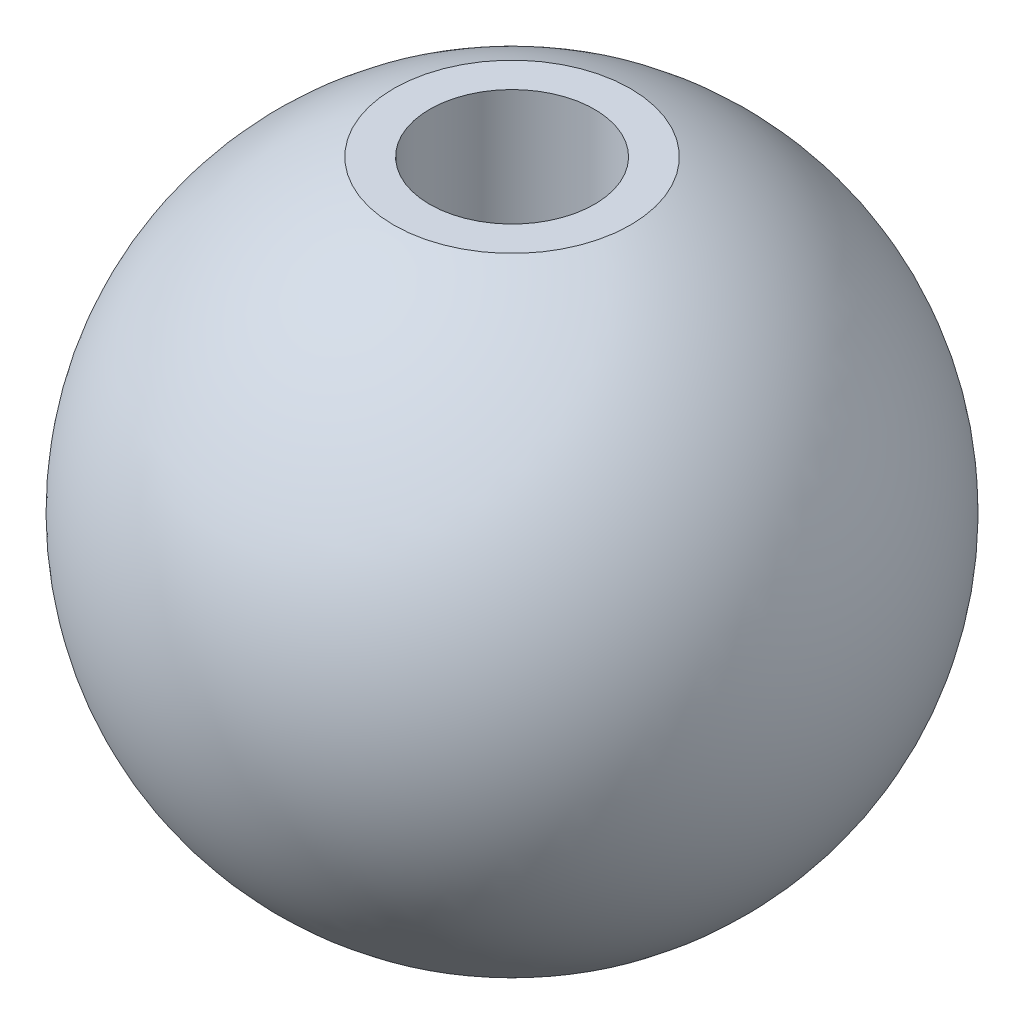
ISO-10303-21;
HEADER;
FILE_DESCRIPTION(('STEP AP214'),'2;1');
FILE_NAME('part.step','',(''),(''),'','','');
FILE_SCHEMA(('AUTOMOTIVE_DESIGN { 1 0 10303 214 1 1 1 1 }'));
ENDSEC;
DATA;
#1=APPLICATION_CONTEXT('core data for automotive mechanical design processes');
#2=APPLICATION_PROTOCOL_DEFINITION('international standard','automotive_design',2000,#1);
#3=PRODUCT_CONTEXT('',#1,'mechanical');
#4=PRODUCT('Part','Part','',(#3));
#5=PRODUCT_RELATED_PRODUCT_CATEGORY('part','',(#4));
#6=PRODUCT_DEFINITION_FORMATION('','',#4);
#7=PRODUCT_DEFINITION_CONTEXT('part definition',#1,'design');
#8=PRODUCT_DEFINITION('design','',#6,#7);
#9=PRODUCT_DEFINITION_SHAPE('','',#8);
#10=(LENGTH_UNIT() NAMED_UNIT(*) SI_UNIT(.MILLI.,.METRE.));
#11=(NAMED_UNIT(*) PLANE_ANGLE_UNIT() SI_UNIT($,.RADIAN.));
#12=(NAMED_UNIT(*) SI_UNIT($,.STERADIAN.) SOLID_ANGLE_UNIT());
#13=UNCERTAINTY_MEASURE_WITH_UNIT(LENGTH_MEASURE(1.E-05),#10,'distance_accuracy_value','');
#14=(GEOMETRIC_REPRESENTATION_CONTEXT(3) GLOBAL_UNCERTAINTY_ASSIGNED_CONTEXT((#13)) GLOBAL_UNIT_ASSIGNED_CONTEXT((#10,
#11,#12)) REPRESENTATION_CONTEXT('',''));
#15=CARTESIAN_POINT('',(0.,0.,0.));
#16=DIRECTION('',(0.,0.,1.));
#17=DIRECTION('',(1.,0.,0.));
#18=AXIS2_PLACEMENT_3D('',#15,#16,#17);
#19=CARTESIAN_POINT('',(0.,0.,0.));
#20=DIRECTION('',(0.,1.,0.));
#21=DIRECTION('',(1.,0.,0.));
#22=AXIS2_PLACEMENT_3D('',#19,#20,#21);
#23=SPHERICAL_SURFACE('',#22,19.05);
#24=CARTESIAN_POINT('',(0.,-17.78,0.));
#25=DIRECTION('',(0.,1.,0.));
#26=DIRECTION('',(0.,0.,1.));
#27=AXIS2_PLACEMENT_3D('',#24,#25,#26);
#28=CIRCLE('',#27,6.83915930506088);
#29=CARTESIAN_POINT('',(6.83915930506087,-17.78,0.));
#30=VERTEX_POINT('',#29);
#31=EDGE_CURVE('E43',#30,#30,#28,.F.);
#32=CARTESIAN_POINT('',(0.,17.78,0.));
#33=DIRECTION('',(0.,1.,0.));
#34=DIRECTION('',(0.,0.,1.));
#35=AXIS2_PLACEMENT_3D('',#32,#33,#34);
#36=CIRCLE('',#35,6.83915930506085);
#37=CARTESIAN_POINT('',(6.83915930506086,17.78,0.));
#38=VERTEX_POINT('',#37);
#39=EDGE_CURVE('E11',#38,#38,#36,.F.);
#40=CARTESIAN_POINT('',(6.83915930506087,-17.78,0.));
#41=CARTESIAN_POINT('',(7.06207478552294,-17.6942569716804,0.));
#42=CARTESIAN_POINT('',(7.28337599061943,-17.6043176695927,0.));
#43=CARTESIAN_POINT('',(7.72244076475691,-17.4161829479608,0.));
#44=CARTESIAN_POINT('',(7.94020433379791,-17.3179875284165,0.));
#45=CARTESIAN_POINT('',(8.37188475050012,-17.1134770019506,0.));
#46=CARTESIAN_POINT('',(8.58580159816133,-17.007161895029,0.));
#47=CARTESIAN_POINT('',(9.0094862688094,-16.7865630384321,0.));
#48=CARTESIAN_POINT('',(9.21925409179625,-16.6722792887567,0.));
#49=CARTESIAN_POINT('',(9.63434391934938,-16.4359046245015,0.));
#50=CARTESIAN_POINT('',(9.83966592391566,-16.3138137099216,0.));
#51=CARTESIAN_POINT('',(10.2455737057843,-16.0619974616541,0.));
#52=CARTESIAN_POINT('',(10.4461594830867,-15.9322721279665,0.));
#53=CARTESIAN_POINT('',(10.842311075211,-15.6653705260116,0.));
#54=CARTESIAN_POINT('',(11.037876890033,-15.5281942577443,0.));
#55=CARTESIAN_POINT('',(11.4237119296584,-15.2465848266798,0.));
#56=CARTESIAN_POINT('',(11.6139811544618,-15.1021516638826,0.));
#57=CARTESIAN_POINT('',(11.9889538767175,-14.8062327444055,0.));
#58=CARTESIAN_POINT('',(12.1736573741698,-14.6547469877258,0.));
#59=CARTESIAN_POINT('',(12.5372373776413,-14.3449371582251,0.));
#60=CARTESIAN_POINT('',(12.7161138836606,-14.1866130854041,0.));
#61=CARTESIAN_POINT('',(13.0677868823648,-13.8633505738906,0.));
#62=CARTESIAN_POINT('',(13.2405833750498,-13.698412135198,0.));
#63=CARTESIAN_POINT('',(13.5798519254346,-13.3621541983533,0.));
#64=CARTESIAN_POINT('',(13.7463239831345,-13.1908347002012,0.));
#65=CARTESIAN_POINT('',(14.0727081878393,-12.8420569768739,0.));
#66=CARTESIAN_POINT('',(14.2326203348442,-12.6645987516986,0.));
#67=CARTESIAN_POINT('',(14.5456585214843,-12.3037945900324,0.));
#68=CARTESIAN_POINT('',(14.6987845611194,-12.1204486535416,0.));
#69=CARTESIAN_POINT('',(14.9980339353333,-11.748128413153,0.));
#70=CARTESIAN_POINT('',(15.144157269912,-11.5591541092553,0.));
#71=CARTESIAN_POINT('',(15.4291945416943,-11.1758444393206,0.));
#72=CARTESIAN_POINT('',(15.5681084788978,-10.9815090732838,0.));
#73=CARTESIAN_POINT('',(15.8385304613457,-10.5877521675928,0.));
#74=CARTESIAN_POINT('',(15.9700385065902,-10.3883306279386,0.));
#75=CARTESIAN_POINT('',(16.2254626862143,-9.98468345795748,0.));
#76=CARTESIAN_POINT('',(16.3493788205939,-9.78045782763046,0.));
#77=CARTESIAN_POINT('',(16.5894438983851,-9.36749135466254,0.));
#78=CARTESIAN_POINT('',(16.7055928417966,-9.15875051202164,0.));
#79=CARTESIAN_POINT('',(16.9299592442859,-8.73704887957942,0.));
#80=CARTESIAN_POINT('',(17.0381767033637,-8.52408808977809,0.));
#81=CARTESIAN_POINT('',(17.2465270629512,-8.09424779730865,0.));
#82=CARTESIAN_POINT('',(17.3466599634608,-7.87736829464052,0.));
#83=CARTESIAN_POINT('',(17.5386995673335,-7.43999735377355,0.));
#84=CARTESIAN_POINT('',(17.6306062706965,-7.21950591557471,0.));
#85=CARTESIAN_POINT('',(17.8060634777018,-6.77522299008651,0.));
#86=CARTESIAN_POINT('',(17.889613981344,-6.55143150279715,0.));
#87=CARTESIAN_POINT('',(18.0482406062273,-6.10086503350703,0.));
#88=CARTESIAN_POINT('',(18.1233167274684,-5.87409005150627,0.));
#89=CARTESIAN_POINT('',(18.2648883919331,-5.41787736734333,0.));
#90=CARTESIAN_POINT('',(18.3313839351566,-5.18843966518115,0.));
#91=CARTESIAN_POINT('',(18.4557003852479,-4.72722608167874,0.));
#92=CARTESIAN_POINT('',(18.5135212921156,-4.4954502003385,0.));
#93=CARTESIAN_POINT('',(18.6204066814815,-4.02988810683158,0.));
#94=CARTESIAN_POINT('',(18.6694711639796,-3.79610189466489,0.));
#95=CARTESIAN_POINT('',(18.7587743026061,-3.32684983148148,0.));
#96=CARTESIAN_POINT('',(18.7990129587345,-3.09138398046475,0.));
#97=CARTESIAN_POINT('',(18.8706075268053,-2.61910570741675,0.));
#98=CARTESIAN_POINT('',(18.9019634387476,-2.38229328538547,0.));
#99=CARTESIAN_POINT('',(18.9557481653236,-1.90765684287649,0.));
#100=CARTESIAN_POINT('',(18.9781769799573,-1.66983282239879,0.));
#101=CARTESIAN_POINT('',(19.0140757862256,-1.19350958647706,0.));
#102=CARTESIAN_POINT('',(19.0275457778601,-0.955010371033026,0.));
#103=CARTESIAN_POINT('',(19.0455078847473,-0.477674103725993,0.));
#104=CARTESIAN_POINT('',(19.05,-0.238837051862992,0.));
#105=CARTESIAN_POINT('',(19.05,0.238837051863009,0.));
#106=CARTESIAN_POINT('',(19.0455078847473,0.47767410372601,0.));
#107=CARTESIAN_POINT('',(19.0275457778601,0.955010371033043,0.));
#108=CARTESIAN_POINT('',(19.0140757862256,1.19350958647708,0.));
#109=CARTESIAN_POINT('',(18.9781769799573,1.66983282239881,0.));
#110=CARTESIAN_POINT('',(18.9557481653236,1.90765684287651,0.));
#111=CARTESIAN_POINT('',(18.9019634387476,2.38229328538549,0.));
#112=CARTESIAN_POINT('',(18.8706075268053,2.61910570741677,0.));
#113=CARTESIAN_POINT('',(18.7990129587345,3.09138398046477,0.));
#114=CARTESIAN_POINT('',(18.7587743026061,3.32684983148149,0.));
#115=CARTESIAN_POINT('',(18.6694711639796,3.7961018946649,0.));
#116=CARTESIAN_POINT('',(18.6204066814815,4.02988810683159,0.));
#117=CARTESIAN_POINT('',(18.5135212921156,4.49545020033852,0.));
#118=CARTESIAN_POINT('',(18.4557003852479,4.72722608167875,0.));
#119=CARTESIAN_POINT('',(18.3313839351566,5.18843966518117,0.));
#120=CARTESIAN_POINT('',(18.2648883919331,5.41787736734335,0.));
#121=CARTESIAN_POINT('',(18.1233167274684,5.87409005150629,0.));
#122=CARTESIAN_POINT('',(18.0482406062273,6.10086503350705,0.));
#123=CARTESIAN_POINT('',(17.889613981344,6.55143150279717,0.));
#124=CARTESIAN_POINT('',(17.8060634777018,6.77522299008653,0.));
#125=CARTESIAN_POINT('',(17.6306062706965,7.21950591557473,0.));
#126=CARTESIAN_POINT('',(17.5386995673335,7.43999735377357,0.));
#127=CARTESIAN_POINT('',(17.3466599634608,7.87736829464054,0.));
#128=CARTESIAN_POINT('',(17.2465270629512,8.09424779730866,0.));
#129=CARTESIAN_POINT('',(17.0381767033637,8.52408808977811,0.));
#130=CARTESIAN_POINT('',(16.9299592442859,8.73704887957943,0.));
#131=CARTESIAN_POINT('',(16.7055928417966,9.15875051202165,0.));
#132=CARTESIAN_POINT('',(16.589443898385,9.36749135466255,0.));
#133=CARTESIAN_POINT('',(16.3493788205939,9.78045782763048,0.));
#134=CARTESIAN_POINT('',(16.2254626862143,9.9846834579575,0.));
#135=CARTESIAN_POINT('',(15.9700385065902,10.3883306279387,0.));
#136=CARTESIAN_POINT('',(15.8385304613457,10.5877521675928,0.));
#137=CARTESIAN_POINT('',(15.5681084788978,10.9815090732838,0.));
#138=CARTESIAN_POINT('',(15.4291945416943,11.1758444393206,0.));
#139=CARTESIAN_POINT('',(15.144157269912,11.5591541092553,0.));
#140=CARTESIAN_POINT('',(14.9980339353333,11.748128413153,0.));
#141=CARTESIAN_POINT('',(14.6987845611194,12.1204486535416,0.));
#142=CARTESIAN_POINT('',(14.5456585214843,12.3037945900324,0.));
#143=CARTESIAN_POINT('',(14.2326203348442,12.6645987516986,0.));
#144=CARTESIAN_POINT('',(14.0727081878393,12.8420569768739,0.));
#145=CARTESIAN_POINT('',(13.7463239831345,13.1908347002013,0.));
#146=CARTESIAN_POINT('',(13.5798519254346,13.3621541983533,0.));
#147=CARTESIAN_POINT('',(13.2405833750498,13.698412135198,0.));
#148=CARTESIAN_POINT('',(13.0677868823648,13.8633505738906,0.));
#149=CARTESIAN_POINT('',(12.7161138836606,14.1866130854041,0.));
#150=CARTESIAN_POINT('',(12.5372373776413,14.3449371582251,0.));
#151=CARTESIAN_POINT('',(12.1736573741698,14.6547469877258,0.));
#152=CARTESIAN_POINT('',(11.9889538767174,14.8062327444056,0.));
#153=CARTESIAN_POINT('',(11.6139811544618,15.1021516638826,0.));
#154=CARTESIAN_POINT('',(11.4237119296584,15.2465848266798,0.));
#155=CARTESIAN_POINT('',(11.037876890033,15.5281942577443,0.));
#156=CARTESIAN_POINT('',(10.842311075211,15.6653705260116,0.));
#157=CARTESIAN_POINT('',(10.4461594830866,15.9322721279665,0.));
#158=CARTESIAN_POINT('',(10.2455737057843,16.0619974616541,0.));
#159=CARTESIAN_POINT('',(9.83966592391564,16.3138137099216,0.));
#160=CARTESIAN_POINT('',(9.63434391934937,16.4359046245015,0.));
#161=CARTESIAN_POINT('',(9.21925409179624,16.6722792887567,0.));
#162=CARTESIAN_POINT('',(9.00948626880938,16.7865630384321,0.));
#163=CARTESIAN_POINT('',(8.58580159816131,17.007161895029,0.));
#164=CARTESIAN_POINT('',(8.3718847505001,17.1134770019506,0.));
#165=CARTESIAN_POINT('',(7.94020433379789,17.3179875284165,0.));
#166=CARTESIAN_POINT('',(7.72244076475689,17.4161829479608,0.));
#167=CARTESIAN_POINT('',(7.28337599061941,17.6043176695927,0.));
#168=CARTESIAN_POINT('',(7.06207478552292,17.6942569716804,0.));
#169=CARTESIAN_POINT('',(6.83915930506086,17.78,0.));
#170=B_SPLINE_CURVE_WITH_KNOTS('',3,(#40,#41,#42,#43,#44,#45,#46,#47,#48,#49,#50,#51,#52,#53,
#54,#55,#56,#57,#58,#59,#60,#61,#62,#63,#64,#65,#66,#67,#68,#69,#70,#71,#72,#73,#74,#75,#76,#77,
#78,#79,#80,#81,#82,#83,#84,#85,#86,#87,#88,#89,#90,#91,#92,#93,#94,#95,#96,#97,#98,#99,#100,
#101,#102,#103,#104,#105,#106,#107,#108,#109,#110,#111,#112,#113,#114,#115,#116,#117,#118,#119,
#120,#121,#122,#123,#124,#125,#126,#127,#128,#129,#130,#131,#132,#133,#134,#135,#136,#137,#138,
#139,#140,#141,#142,#143,#144,#145,#146,#147,#148,#149,#150,#151,#152,#153,#154,#155,#156,#157,
#158,#159,#160,#161,#162,#163,#164,#165,#166,#167,#168,#169),.UNSPECIFIED.,.F.,.F.,(4,2,2,2,2,2,
2,2,2,2,2,2,2,2,2,2,2,2,2,2,2,2,2,2,2,2,2,2,2,2,2,2,2,2,2,2,2,2,2,2,2,2,2,2,2,2,2,2,2,2,2,2,2,2,
2,2,2,2,2,2,2,2,2,2,4),(0.,0.716468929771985,1.43293785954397,2.14940678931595,2.86587571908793,
3.58234464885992,4.2988135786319,5.01528250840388,5.73175143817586,6.44822036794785,
7.16468929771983,7.88115822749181,8.5976271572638,9.31409608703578,10.0305650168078,
10.7470339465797,11.4635028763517,12.1799718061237,12.8964407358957,13.6129096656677,
14.3293785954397,15.0458475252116,15.7623164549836,16.4787853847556,17.1952543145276,
17.9117232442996,18.6281921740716,19.3446611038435,20.0611300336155,20.7775989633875,
21.4940678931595,22.2105368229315,22.9270057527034,23.6434746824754,24.3599436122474,
25.0764125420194,25.7928814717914,26.5093504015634,27.2258193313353,27.9422882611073,
28.6587571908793,29.3752261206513,30.0916950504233,30.8081639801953,31.5246329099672,
32.2411018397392,32.9575707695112,33.6740396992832,34.3905086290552,35.1069775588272,
35.8234464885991,36.5399154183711,37.2563843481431,37.9728532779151,38.6893222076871,
39.4057911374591,40.122260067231,40.838728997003,41.555197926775,42.271666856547,
42.988135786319,43.704604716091,44.4210736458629,45.1375425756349,45.8540115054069),.UNSPECIFIED.);
#171=EDGE_CURVE('BSEAM31',#30,#38,#170,.T.);
#172=ORIENTED_EDGE('',*,*,#31,.F.);
#173=ORIENTED_EDGE('',*,*,#39,.T.);
#174=ORIENTED_EDGE('',*,*,#171,.T.);
#175=ORIENTED_EDGE('',*,*,#171,.F.);
#176=EDGE_LOOP('',(#172,#174,#173,#175));
#177=FACE_BOUND('',#176,.T.);
#178=ADVANCED_FACE('F31',(#177),#23,.T.);
#179=CARTESIAN_POINT('',(0.,-19.05,0.));
#180=DIRECTION('',(0.,1.,0.));
#181=DIRECTION('',(0.,0.,1.));
#182=AXIS2_PLACEMENT_3D('',#179,#180,#181);
#183=CYLINDRICAL_SURFACE('',#182,4.7625);
#184=CARTESIAN_POINT('',(0.,-17.78,0.));
#185=DIRECTION('',(0.,1.,0.));
#186=DIRECTION('',(0.,0.,1.));
#187=AXIS2_PLACEMENT_3D('',#184,#185,#186);
#188=CIRCLE('',#187,4.7625);
#189=CARTESIAN_POINT('',(0.,-17.78,4.7625));
#190=VERTEX_POINT('',#189);
#191=EDGE_CURVE('E34',#190,#190,#188,.F.);
#192=CARTESIAN_POINT('',(0.,17.78,0.));
#193=DIRECTION('',(0.,1.,0.));
#194=DIRECTION('',(0.,0.,1.));
#195=AXIS2_PLACEMENT_3D('',#192,#193,#194);
#196=CIRCLE('',#195,4.7625);
#197=CARTESIAN_POINT('',(0.,17.78,4.7625));
#198=VERTEX_POINT('',#197);
#199=EDGE_CURVE('E38',#198,#198,#196,.F.);
#200=CARTESIAN_POINT('',(0.,-17.78,4.7625));
#201=CARTESIAN_POINT('',(0.,-17.4095833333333,4.7625));
#202=CARTESIAN_POINT('',(0.,-17.0391666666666,4.7625));
#203=CARTESIAN_POINT('',(0.,-16.2983333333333,4.7625));
#204=CARTESIAN_POINT('',(0.,-15.9279166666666,4.7625));
#205=CARTESIAN_POINT('',(0.,-15.1870833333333,4.7625));
#206=CARTESIAN_POINT('',(0.,-14.8166666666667,4.7625));
#207=CARTESIAN_POINT('',(0.,-14.0758333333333,4.7625));
#208=CARTESIAN_POINT('',(0.,-13.7054166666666,4.7625));
#209=CARTESIAN_POINT('',(0.,-12.9645833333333,4.7625));
#210=CARTESIAN_POINT('',(0.,-12.5941666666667,4.7625));
#211=CARTESIAN_POINT('',(0.,-11.8533333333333,4.7625));
#212=CARTESIAN_POINT('',(0.,-11.4829166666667,4.7625));
#213=CARTESIAN_POINT('',(0.,-10.7420833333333,4.7625));
#214=CARTESIAN_POINT('',(0.,-10.3716666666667,4.7625));
#215=CARTESIAN_POINT('',(0.,-9.63083333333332,4.7625));
#216=CARTESIAN_POINT('',(0.,-9.26041666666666,4.7625));
#217=CARTESIAN_POINT('',(0.,-8.51958333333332,4.7625));
#218=CARTESIAN_POINT('',(0.,-8.14916666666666,4.7625));
#219=CARTESIAN_POINT('',(0.,-7.40833333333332,4.7625));
#220=CARTESIAN_POINT('',(0.,-7.03791666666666,4.7625));
#221=CARTESIAN_POINT('',(0.,-6.29708333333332,4.7625));
#222=CARTESIAN_POINT('',(0.,-5.92666666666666,4.7625));
#223=CARTESIAN_POINT('',(0.,-5.18583333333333,4.7625));
#224=CARTESIAN_POINT('',(0.,-4.81541666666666,4.7625));
#225=CARTESIAN_POINT('',(0.,-4.07458333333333,4.7625));
#226=CARTESIAN_POINT('',(0.,-3.70416666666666,4.7625));
#227=CARTESIAN_POINT('',(0.,-2.96333333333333,4.7625));
#228=CARTESIAN_POINT('',(0.,-2.59291666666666,4.7625));
#229=CARTESIAN_POINT('',(0.,-1.85208333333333,4.7625));
#230=CARTESIAN_POINT('',(0.,-1.48166666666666,4.7625));
#231=CARTESIAN_POINT('',(0.,-0.740833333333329,4.7625));
#232=CARTESIAN_POINT('',(0.,-0.370416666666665,4.7625));
#233=CARTESIAN_POINT('',(0.,0.370416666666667,4.7625));
#234=CARTESIAN_POINT('',(0.,0.740833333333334,4.7625));
#235=CARTESIAN_POINT('',(0.,1.48166666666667,4.7625));
#236=CARTESIAN_POINT('',(0.,1.85208333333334,4.7625));
#237=CARTESIAN_POINT('',(0.,2.59291666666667,4.7625));
#238=CARTESIAN_POINT('',(0.,2.96333333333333,4.7625));
#239=CARTESIAN_POINT('',(0.,3.70416666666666,4.7625));
#240=CARTESIAN_POINT('',(0.,4.07458333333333,4.7625));
#241=CARTESIAN_POINT('',(0.,4.81541666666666,4.7625));
#242=CARTESIAN_POINT('',(0.,5.18583333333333,4.7625));
#243=CARTESIAN_POINT('',(0.,5.92666666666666,4.7625));
#244=CARTESIAN_POINT('',(0.,6.29708333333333,4.7625));
#245=CARTESIAN_POINT('',(0.,7.03791666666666,4.7625));
#246=CARTESIAN_POINT('',(0.,7.40833333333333,4.7625));
#247=CARTESIAN_POINT('',(0.,8.14916666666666,4.7625));
#248=CARTESIAN_POINT('',(0.,8.51958333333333,4.7625));
#249=CARTESIAN_POINT('',(0.,9.26041666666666,4.7625));
#250=CARTESIAN_POINT('',(0.,9.63083333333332,4.7625));
#251=CARTESIAN_POINT('',(0.,10.3716666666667,4.7625));
#252=CARTESIAN_POINT('',(0.,10.7420833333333,4.7625));
#253=CARTESIAN_POINT('',(0.,11.4829166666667,4.7625));
#254=CARTESIAN_POINT('',(0.,11.8533333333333,4.7625));
#255=CARTESIAN_POINT('',(0.,12.5941666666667,4.7625));
#256=CARTESIAN_POINT('',(0.,12.9645833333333,4.7625));
#257=CARTESIAN_POINT('',(0.,13.7054166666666,4.7625));
#258=CARTESIAN_POINT('',(0.,14.0758333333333,4.7625));
#259=CARTESIAN_POINT('',(0.,14.8166666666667,4.7625));
#260=CARTESIAN_POINT('',(0.,15.1870833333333,4.7625));
#261=CARTESIAN_POINT('',(0.,15.9279166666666,4.7625));
#262=CARTESIAN_POINT('',(0.,16.2983333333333,4.7625));
#263=CARTESIAN_POINT('',(0.,17.0391666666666,4.7625));
#264=CARTESIAN_POINT('',(0.,17.4095833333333,4.7625));
#265=CARTESIAN_POINT('',(0.,17.78,4.7625));
#266=B_SPLINE_CURVE_WITH_KNOTS('',3,(#200,#201,#202,#203,#204,#205,#206,#207,#208,#209,#210,
#211,#212,#213,#214,#215,#216,#217,#218,#219,#220,#221,#222,#223,#224,#225,#226,#227,#228,#229,
#230,#231,#232,#233,#234,#235,#236,#237,#238,#239,#240,#241,#242,#243,#244,#245,#246,#247,#248,
#249,#250,#251,#252,#253,#254,#255,#256,#257,#258,#259,#260,#261,#262,#263,#264,#265),
.UNSPECIFIED.,.F.,.F.,(4,2,2,2,2,2,2,2,2,2,2,2,2,2,2,2,2,2,2,2,2,2,2,2,2,2,2,2,2,2,2,2,4),(0.,
1.11125,2.2225,3.33375,4.445,5.55625,6.66749999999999,7.77874999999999,8.88999999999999,
10.00125,11.1125,12.22375,13.335,14.44625,15.5575,16.66875,17.78,18.89125,20.0025,21.11375,
22.225,23.33625,24.4475,25.55875,26.67,27.78125,28.8925,30.00375,31.115,32.22625,33.3375,
34.44875,35.56),.UNSPECIFIED.);
#267=EDGE_CURVE('BSEAM51',#190,#198,#266,.T.);
#268=ORIENTED_EDGE('',*,*,#191,.T.);
#269=ORIENTED_EDGE('',*,*,#199,.F.);
#270=ORIENTED_EDGE('',*,*,#267,.T.);
#271=ORIENTED_EDGE('',*,*,#267,.F.);
#272=EDGE_LOOP('',(#268,#270,#269,#271));
#273=FACE_BOUND('',#272,.T.);
#274=ADVANCED_FACE('F51',(#273),#183,.F.);
#275=CARTESIAN_POINT('',(-29.5235569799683,17.78,0.));
#276=DIRECTION('',(0.,1.,0.));
#277=DIRECTION('',(0.,0.,1.));
#278=AXIS2_PLACEMENT_3D('',#275,#276,#277);
#279=PLANE('',#278);
#280=ORIENTED_EDGE('',*,*,#39,.F.);
#281=EDGE_LOOP('',(#280));
#282=FACE_BOUND('',#281,.T.);
#283=ORIENTED_EDGE('',*,*,#199,.T.);
#284=EDGE_LOOP('',(#283));
#285=FACE_BOUND('',#284,.T.);
#286=ADVANCED_FACE('F56',(#282,#285),#279,.T.);
#287=CARTESIAN_POINT('',(-29.5235569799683,-17.78,0.));
#288=DIRECTION('',(0.,1.,0.));
#289=DIRECTION('',(0.,0.,1.));
#290=AXIS2_PLACEMENT_3D('',#287,#288,#289);
#291=PLANE('',#290);
#292=ORIENTED_EDGE('',*,*,#31,.T.);
#293=EDGE_LOOP('',(#292));
#294=FACE_BOUND('',#293,.T.);
#295=ORIENTED_EDGE('',*,*,#191,.F.);
#296=EDGE_LOOP('',(#295));
#297=FACE_BOUND('',#296,.T.);
#298=ADVANCED_FACE('F54',(#294,#297),#291,.F.);
#299=CLOSED_SHELL('',(#178,#274,#286,#298));
#300=MANIFOLD_SOLID_BREP('B2',#299);
#301=ADVANCED_BREP_SHAPE_REPRESENTATION('',(#18,#300),#14);
#302=SHAPE_DEFINITION_REPRESENTATION(#9,#301);
ENDSEC;
END-ISO-10303-21;
